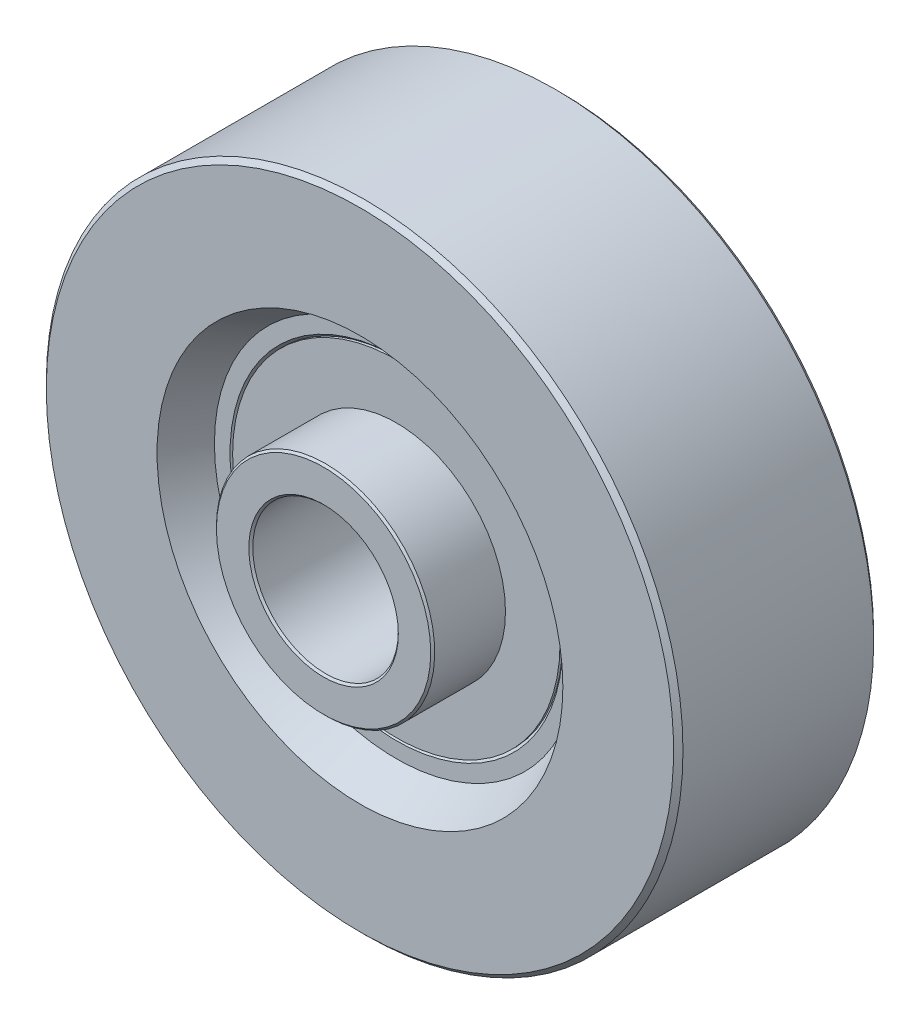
ISO-10303-21;
HEADER;
FILE_DESCRIPTION(('STEP AP214'),'2;1');
FILE_NAME('part.step','',(''),(''),'','','');
FILE_SCHEMA(('AUTOMOTIVE_DESIGN { 1 0 10303 214 1 1 1 1 }'));
ENDSEC;
DATA;
#1=APPLICATION_CONTEXT('core data for automotive mechanical design processes');
#2=APPLICATION_PROTOCOL_DEFINITION('international standard','automotive_design',2000,#1);
#3=PRODUCT_CONTEXT('',#1,'mechanical');
#4=PRODUCT('Part','Part','',(#3));
#5=PRODUCT_RELATED_PRODUCT_CATEGORY('part','',(#4));
#6=PRODUCT_DEFINITION_FORMATION('','',#4);
#7=PRODUCT_DEFINITION_CONTEXT('part definition',#1,'design');
#8=PRODUCT_DEFINITION('design','',#6,#7);
#9=PRODUCT_DEFINITION_SHAPE('','',#8);
#10=(LENGTH_UNIT() NAMED_UNIT(*) SI_UNIT(.MILLI.,.METRE.));
#11=(NAMED_UNIT(*) PLANE_ANGLE_UNIT() SI_UNIT($,.RADIAN.));
#12=(NAMED_UNIT(*) SI_UNIT($,.STERADIAN.) SOLID_ANGLE_UNIT());
#13=UNCERTAINTY_MEASURE_WITH_UNIT(LENGTH_MEASURE(1.E-05),#10,'distance_accuracy_value','');
#14=(GEOMETRIC_REPRESENTATION_CONTEXT(3) GLOBAL_UNCERTAINTY_ASSIGNED_CONTEXT((#13)) GLOBAL_UNIT_ASSIGNED_CONTEXT((#10,
#11,#12)) REPRESENTATION_CONTEXT('',''));
#15=CARTESIAN_POINT('',(0.,0.,0.));
#16=DIRECTION('',(0.,0.,1.));
#17=DIRECTION('',(1.,0.,0.));
#18=AXIS2_PLACEMENT_3D('',#15,#16,#17);
#19=CARTESIAN_POINT('',(0.,0.,0.));
#20=DIRECTION('',(0.,0.,-1.));
#21=DIRECTION('',(-1.,0.,0.));
#22=AXIS2_PLACEMENT_3D('',#19,#20,#21);
#23=CYLINDRICAL_SURFACE('',#22,4.);
#24=CARTESIAN_POINT('',(0.,0.,-7.3909090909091));
#25=DIRECTION('',(0.,0.,-1.));
#26=DIRECTION('',(-1.,0.,0.));
#27=AXIS2_PLACEMENT_3D('',#24,#25,#26);
#28=CIRCLE('',#27,4.);
#29=CARTESIAN_POINT('',(-4.,0.,-7.3909090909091));
#30=VERTEX_POINT('',#29);
#31=EDGE_CURVE('E24',#30,#30,#28,.F.);
#32=ORIENTED_EDGE('',*,*,#31,.F.);
#33=EDGE_LOOP('',(#32));
#34=FACE_BOUND('',#33,.T.);
#35=CARTESIAN_POINT('',(0.,0.,7.3909090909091));
#36=DIRECTION('',(0.,0.,-1.));
#37=DIRECTION('',(-1.,0.,0.));
#38=AXIS2_PLACEMENT_3D('',#35,#36,#37);
#39=CIRCLE('',#38,4.);
#40=CARTESIAN_POINT('',(-4.,0.,7.3909090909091));
#41=VERTEX_POINT('',#40);
#42=EDGE_CURVE('E325',#41,#41,#39,.T.);
#43=ORIENTED_EDGE('',*,*,#42,.F.);
#44=EDGE_LOOP('',(#43));
#45=FACE_BOUND('',#44,.T.);
#46=ADVANCED_FACE('F12',(#34,#45),#23,.F.);
#47=CARTESIAN_POINT('',(0.,0.,-7.49999999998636));
#48=DIRECTION('',(0.,0.,-1.));
#49=DIRECTION('',(-1.,0.,0.));
#50=AXIS2_PLACEMENT_3D('',#47,#48,#49);
#51=CONICAL_SURFACE('',#50,4.10909090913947,0.785398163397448);
#52=CARTESIAN_POINT('',(0.,0.,-7.49999999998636));
#53=DIRECTION('',(0.,0.,-1.));
#54=DIRECTION('',(-1.,0.,0.));
#55=AXIS2_PLACEMENT_3D('',#52,#53,#54);
#56=CIRCLE('',#55,4.10909090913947);
#57=CARTESIAN_POINT('',(-4.10909090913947,0.,-7.49999999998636));
#58=VERTEX_POINT('',#57);
#59=EDGE_CURVE('E326',#58,#58,#56,.F.);
#60=ORIENTED_EDGE('',*,*,#59,.F.);
#61=EDGE_LOOP('',(#60));
#62=FACE_BOUND('',#61,.T.);
#63=ORIENTED_EDGE('',*,*,#31,.T.);
#64=EDGE_LOOP('',(#63));
#65=FACE_BOUND('',#64,.T.);
#66=ADVANCED_FACE('F291',(#62,#65),#51,.F.);
#67=CARTESIAN_POINT('',(0.,5.,-7.5));
#68=DIRECTION('',(0.,0.,-1.));
#69=DIRECTION('',(-1.,0.,0.));
#70=AXIS2_PLACEMENT_3D('',#67,#68,#69);
#71=PLANE('',#70);
#72=ORIENTED_EDGE('',*,*,#59,.T.);
#73=EDGE_LOOP('',(#72));
#74=FACE_BOUND('',#73,.T.);
#75=CARTESIAN_POINT('',(0.,0.,-7.49999999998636));
#76=DIRECTION('',(0.,0.,1.));
#77=DIRECTION('',(1.,0.,0.));
#78=AXIS2_PLACEMENT_3D('',#75,#76,#77);
#79=CIRCLE('',#78,5.89090909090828);
#80=CARTESIAN_POINT('',(5.89090909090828,0.,-7.49999999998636));
#81=VERTEX_POINT('',#80);
#82=EDGE_CURVE('E339',#81,#81,#79,.F.);
#83=ORIENTED_EDGE('',*,*,#82,.T.);
#84=EDGE_LOOP('',(#83));
#85=FACE_BOUND('',#84,.T.);
#86=ADVANCED_FACE('F282',(#74,#85),#71,.T.);
#87=CARTESIAN_POINT('',(0.,0.,-7.39090909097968));
#88=DIRECTION('',(0.,0.,1.));
#89=DIRECTION('',(1.,0.,0.));
#90=AXIS2_PLACEMENT_3D('',#87,#88,#89);
#91=CONICAL_SURFACE('',#90,5.99999999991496,0.785398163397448);
#92=CARTESIAN_POINT('',(0.,0.,-7.39090909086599));
#93=DIRECTION('',(0.,0.,1.));
#94=DIRECTION('',(0.,1.,0.));
#95=AXIS2_PLACEMENT_3D('',#92,#93,#94);
#96=CIRCLE('',#95,5.99999999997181);
#97=CARTESIAN_POINT('',(0.,5.99999999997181,-7.39090909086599));
#98=VERTEX_POINT('',#97);
#99=EDGE_CURVE('E333',#98,#98,#96,.F.);
#100=ORIENTED_EDGE('',*,*,#99,.T.);
#101=EDGE_LOOP('',(#100));
#102=FACE_BOUND('',#101,.T.);
#103=ORIENTED_EDGE('',*,*,#82,.F.);
#104=EDGE_LOOP('',(#103));
#105=FACE_BOUND('',#104,.T.);
#106=ADVANCED_FACE('F273',(#102,#105),#91,.T.);
#107=CARTESIAN_POINT('',(0.,0.,-4.0586961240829));
#108=DIRECTION('',(0.,0.,-1.));
#109=DIRECTION('',(-1.,0.,0.));
#110=AXIS2_PLACEMENT_3D('',#107,#108,#109);
#111=CYLINDRICAL_SURFACE('',#110,6.);
#112=CARTESIAN_POINT('',(0.,0.,-3.5));
#113=DIRECTION('',(0.,0.,-1.));
#114=DIRECTION('',(-1.,0.,0.));
#115=AXIS2_PLACEMENT_3D('',#112,#113,#114);
#116=CIRCLE('',#115,6.);
#117=CARTESIAN_POINT('',(-6.,0.,-3.5));
#118=VERTEX_POINT('',#117);
#119=EDGE_CURVE('E16',#118,#118,#116,.F.);
#120=ORIENTED_EDGE('',*,*,#119,.F.);
#121=EDGE_LOOP('',(#120));
#122=FACE_BOUND('',#121,.T.);
#123=ORIENTED_EDGE('',*,*,#99,.F.);
#124=EDGE_LOOP('',(#123));
#125=FACE_BOUND('',#124,.T.);
#126=ADVANCED_FACE('F264',(#122,#125),#111,.T.);
#127=CARTESIAN_POINT('',(0.,0.,7.5));
#128=DIRECTION('',(0.,0.,1.));
#129=DIRECTION('',(1.,0.,0.));
#130=AXIS2_PLACEMENT_3D('',#127,#128,#129);
#131=CONICAL_SURFACE('',#130,4.10909090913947,0.785398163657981);
#132=ORIENTED_EDGE('',*,*,#42,.T.);
#133=EDGE_LOOP('',(#132));
#134=FACE_BOUND('',#133,.T.);
#135=CARTESIAN_POINT('',(0.,0.,7.5));
#136=DIRECTION('',(0.,0.,1.));
#137=DIRECTION('',(1.,0.,0.));
#138=AXIS2_PLACEMENT_3D('',#135,#136,#137);
#139=CIRCLE('',#138,4.10909090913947);
#140=CARTESIAN_POINT('',(4.10909090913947,0.,7.5));
#141=VERTEX_POINT('',#140);
#142=EDGE_CURVE('E330',#141,#141,#139,.F.);
#143=ORIENTED_EDGE('',*,*,#142,.F.);
#144=EDGE_LOOP('',(#143));
#145=FACE_BOUND('',#144,.T.);
#146=ADVANCED_FACE('F255',(#134,#145),#131,.F.);
#147=CARTESIAN_POINT('',(0.,5.,7.5));
#148=DIRECTION('',(0.,0.,1.));
#149=DIRECTION('',(1.,0.,0.));
#150=AXIS2_PLACEMENT_3D('',#147,#148,#149);
#151=PLANE('',#150);
#152=CARTESIAN_POINT('',(0.,0.,7.5));
#153=DIRECTION('',(0.,0.,-1.));
#154=DIRECTION('',(-1.,0.,0.));
#155=AXIS2_PLACEMENT_3D('',#152,#153,#154);
#156=CIRCLE('',#155,5.89090909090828);
#157=CARTESIAN_POINT('',(-5.89090909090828,0.,7.5));
#158=VERTEX_POINT('',#157);
#159=EDGE_CURVE('E27',#158,#158,#156,.F.);
#160=ORIENTED_EDGE('',*,*,#159,.T.);
#161=EDGE_LOOP('',(#160));
#162=FACE_BOUND('',#161,.T.);
#163=ORIENTED_EDGE('',*,*,#142,.T.);
#164=EDGE_LOOP('',(#163));
#165=FACE_BOUND('',#164,.T.);
#166=ADVANCED_FACE('F246',(#162,#165),#151,.T.);
#167=CARTESIAN_POINT('',(0.,0.,7.39090909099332));
#168=DIRECTION('',(0.,0.,-1.));
#169=DIRECTION('',(-1.,0.,0.));
#170=AXIS2_PLACEMENT_3D('',#167,#168,#169);
#171=CONICAL_SURFACE('',#170,5.99999999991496,0.785398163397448);
#172=ORIENTED_EDGE('',*,*,#159,.F.);
#173=EDGE_LOOP('',(#172));
#174=FACE_BOUND('',#173,.T.);
#175=CARTESIAN_POINT('',(0.,0.,7.39090909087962));
#176=DIRECTION('',(0.,0.,-1.));
#177=DIRECTION('',(0.,1.,0.));
#178=AXIS2_PLACEMENT_3D('',#175,#176,#177);
#179=CIRCLE('',#178,5.99999999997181);
#180=CARTESIAN_POINT('',(0.,5.99999999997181,7.39090909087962));
#181=VERTEX_POINT('',#180);
#182=EDGE_CURVE('E47',#181,#181,#179,.F.);
#183=ORIENTED_EDGE('',*,*,#182,.T.);
#184=EDGE_LOOP('',(#183));
#185=FACE_BOUND('',#184,.T.);
#186=ADVANCED_FACE('F239',(#174,#185),#171,.T.);
#187=CARTESIAN_POINT('',(0.,0.,4.05869612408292));
#188=DIRECTION('',(0.,0.,-1.));
#189=DIRECTION('',(-1.,0.,0.));
#190=AXIS2_PLACEMENT_3D('',#187,#188,#189);
#191=CYLINDRICAL_SURFACE('',#190,6.);
#192=ORIENTED_EDGE('',*,*,#182,.F.);
#193=EDGE_LOOP('',(#192));
#194=FACE_BOUND('',#193,.T.);
#195=CARTESIAN_POINT('',(0.,0.,3.5));
#196=DIRECTION('',(0.,0.,1.));
#197=DIRECTION('',(1.,0.,0.));
#198=AXIS2_PLACEMENT_3D('',#195,#196,#197);
#199=CIRCLE('',#198,6.);
#200=CARTESIAN_POINT('',(6.,0.,3.5));
#201=VERTEX_POINT('',#200);
#202=EDGE_CURVE('E8',#201,#201,#199,.F.);
#203=ORIENTED_EDGE('',*,*,#202,.F.);
#204=EDGE_LOOP('',(#203));
#205=FACE_BOUND('',#204,.T.);
#206=ADVANCED_FACE('F116',(#194,#205),#191,.T.);
#207=CARTESIAN_POINT('',(0.,0.,0.));
#208=DIRECTION('',(0.,0.,-1.));
#209=DIRECTION('',(-1.,0.,0.));
#210=AXIS2_PLACEMENT_3D('',#207,#208,#209);
#211=CYLINDRICAL_SURFACE('',#210,17.5);
#212=CARTESIAN_POINT('',(0.,0.,5.24264705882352));
#213=DIRECTION('',(0.,0.,-1.));
#214=DIRECTION('',(-1.,0.,0.));
#215=AXIS2_PLACEMENT_3D('',#212,#213,#214);
#216=CIRCLE('',#215,17.5);
#217=CARTESIAN_POINT('',(-17.5,0.,5.24264705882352));
#218=VERTEX_POINT('',#217);
#219=EDGE_CURVE('E34',#218,#218,#216,.T.);
#220=ORIENTED_EDGE('',*,*,#219,.T.);
#221=EDGE_LOOP('',(#220));
#222=FACE_BOUND('',#221,.T.);
#223=CARTESIAN_POINT('',(0.,0.,-5.2426470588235));
#224=DIRECTION('',(0.,0.,-1.));
#225=DIRECTION('',(-1.,0.,0.));
#226=AXIS2_PLACEMENT_3D('',#223,#224,#225);
#227=CIRCLE('',#226,17.5);
#228=CARTESIAN_POINT('',(-17.5,0.,-5.2426470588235));
#229=VERTEX_POINT('',#228);
#230=EDGE_CURVE('E33',#229,#229,#227,.F.);
#231=ORIENTED_EDGE('',*,*,#230,.T.);
#232=EDGE_LOOP('',(#231));
#233=FACE_BOUND('',#232,.T.);
#234=ADVANCED_FACE('F86',(#222,#233),#211,.T.);
#235=CARTESIAN_POINT('',(0.,0.,-5.24264705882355));
#236=DIRECTION('',(0.,0.,1.));
#237=DIRECTION('',(1.,0.,0.));
#238=AXIS2_PLACEMENT_3D('',#235,#236,#237);
#239=CONICAL_SURFACE('',#238,17.5,0.785398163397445);
#240=CARTESIAN_POINT('',(0.,0.,-5.5));
#241=DIRECTION('',(0.,0.,1.));
#242=DIRECTION('',(1.,0.,0.));
#243=AXIS2_PLACEMENT_3D('',#240,#241,#242);
#244=CIRCLE('',#243,17.2426470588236);
#245=CARTESIAN_POINT('',(17.2426470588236,0.,-5.5));
#246=VERTEX_POINT('',#245);
#247=EDGE_CURVE('E37',#246,#246,#244,.T.);
#248=ORIENTED_EDGE('',*,*,#247,.T.);
#249=EDGE_LOOP('',(#248));
#250=FACE_BOUND('',#249,.T.);
#251=ORIENTED_EDGE('',*,*,#230,.F.);
#252=EDGE_LOOP('',(#251));
#253=FACE_BOUND('',#252,.T.);
#254=ADVANCED_FACE('F115',(#250,#253),#239,.T.);
#255=CARTESIAN_POINT('',(0.,14.1986737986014,-5.5));
#256=DIRECTION('',(0.,0.,-1.));
#257=DIRECTION('',(-1.,0.,0.));
#258=AXIS2_PLACEMENT_3D('',#255,#256,#257);
#259=PLANE('',#258);
#260=CARTESIAN_POINT('',(0.,0.,-5.5));
#261=DIRECTION('',(0.,0.,-1.));
#262=DIRECTION('',(-1.,0.,0.));
#263=AXIS2_PLACEMENT_3D('',#260,#261,#262);
#264=CIRCLE('',#263,11.1547005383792);
#265=CARTESIAN_POINT('',(-11.1547005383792,0.,-5.5));
#266=VERTEX_POINT('',#265);
#267=EDGE_CURVE('E53',#266,#266,#264,.F.);
#268=ORIENTED_EDGE('',*,*,#267,.T.);
#269=EDGE_LOOP('',(#268));
#270=FACE_BOUND('',#269,.T.);
#271=ORIENTED_EDGE('',*,*,#247,.F.);
#272=EDGE_LOOP('',(#271));
#273=FACE_BOUND('',#272,.T.);
#274=ADVANCED_FACE('F119',(#270,#273),#259,.T.);
#275=CARTESIAN_POINT('',(0.,0.,-5.5));
#276=DIRECTION('',(0.,0.,-1.));
#277=DIRECTION('',(-1.,0.,0.));
#278=AXIS2_PLACEMENT_3D('',#275,#276,#277);
#279=CONICAL_SURFACE('',#278,11.1547005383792,0.523598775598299);
#280=ORIENTED_EDGE('',*,*,#267,.F.);
#281=EDGE_LOOP('',(#280));
#282=FACE_BOUND('',#281,.T.);
#283=CARTESIAN_POINT('',(0.,0.,-3.5));
#284=DIRECTION('',(0.,0.,-1.));
#285=DIRECTION('',(-1.,0.,0.));
#286=AXIS2_PLACEMENT_3D('',#283,#284,#285);
#287=CIRCLE('',#286,10.);
#288=CARTESIAN_POINT('',(-10.,0.,-3.5));
#289=VERTEX_POINT('',#288);
#290=EDGE_CURVE('E59',#289,#289,#287,.T.);
#291=ORIENTED_EDGE('',*,*,#290,.F.);
#292=EDGE_LOOP('',(#291));
#293=FACE_BOUND('',#292,.T.);
#294=ADVANCED_FACE('F123',(#282,#293),#279,.F.);
#295=CARTESIAN_POINT('',(0.,9.57,-3.5));
#296=DIRECTION('',(0.,0.,-1.));
#297=DIRECTION('',(-1.,0.,0.));
#298=AXIS2_PLACEMENT_3D('',#295,#296,#297);
#299=PLANE('',#298);
#300=CARTESIAN_POINT('',(0.,0.,-3.5));
#301=DIRECTION('',(0.,0.,-1.));
#302=DIRECTION('',(-1.,0.,0.));
#303=AXIS2_PLACEMENT_3D('',#300,#301,#302);
#304=CIRCLE('',#303,9.14);
#305=CARTESIAN_POINT('',(-9.14,0.,-3.5));
#306=VERTEX_POINT('',#305);
#307=EDGE_CURVE('E65',#306,#306,#304,.F.);
#308=ORIENTED_EDGE('',*,*,#307,.T.);
#309=EDGE_LOOP('',(#308));
#310=FACE_BOUND('',#309,.T.);
#311=ORIENTED_EDGE('',*,*,#290,.T.);
#312=EDGE_LOOP('',(#311));
#313=FACE_BOUND('',#312,.T.);
#314=ADVANCED_FACE('F128',(#310,#313),#299,.T.);
#315=CARTESIAN_POINT('',(0.,0.,-3.5));
#316=DIRECTION('',(0.,0.,-1.));
#317=DIRECTION('',(-1.,0.,0.));
#318=AXIS2_PLACEMENT_3D('',#315,#316,#317);
#319=CONICAL_SURFACE('',#318,9.14,0.785398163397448);
#320=ORIENTED_EDGE('',*,*,#307,.F.);
#321=EDGE_LOOP('',(#320));
#322=FACE_BOUND('',#321,.T.);
#323=CARTESIAN_POINT('',(0.,0.,-3.36));
#324=DIRECTION('',(0.,0.,-1.));
#325=DIRECTION('',(0.,1.,0.));
#326=AXIS2_PLACEMENT_3D('',#323,#324,#325);
#327=CIRCLE('',#326,9.);
#328=CARTESIAN_POINT('',(0.,9.,-3.36));
#329=VERTEX_POINT('',#328);
#330=EDGE_CURVE('E40',#329,#329,#327,.T.);
#331=ORIENTED_EDGE('',*,*,#330,.F.);
#332=EDGE_LOOP('',(#331));
#333=FACE_BOUND('',#332,.T.);
#334=ADVANCED_FACE('F87',(#322,#333),#319,.F.);
#335=CARTESIAN_POINT('',(0.,0.,-3.0625));
#336=DIRECTION('',(0.,0.,-1.));
#337=DIRECTION('',(-1.,0.,0.));
#338=AXIS2_PLACEMENT_3D('',#335,#336,#337);
#339=CYLINDRICAL_SURFACE('',#338,9.);
#340=ORIENTED_EDGE('',*,*,#330,.T.);
#341=EDGE_LOOP('',(#340));
#342=FACE_BOUND('',#341,.T.);
#343=CARTESIAN_POINT('',(0.,0.,-3.5));
#344=DIRECTION('',(0.,0.,-1.));
#345=DIRECTION('',(-1.,0.,0.));
#346=AXIS2_PLACEMENT_3D('',#343,#344,#345);
#347=CIRCLE('',#346,9.);
#348=CARTESIAN_POINT('',(-9.,0.,-3.5));
#349=VERTEX_POINT('',#348);
#350=EDGE_CURVE('E44',#349,#349,#347,.F.);
#351=ORIENTED_EDGE('',*,*,#350,.T.);
#352=EDGE_LOOP('',(#351));
#353=FACE_BOUND('',#352,.T.);
#354=ADVANCED_FACE('F72',(#342,#353),#339,.T.);
#355=CARTESIAN_POINT('',(0.,7.5,-3.5));
#356=DIRECTION('',(0.,0.,-1.));
#357=DIRECTION('',(-1.,0.,0.));
#358=AXIS2_PLACEMENT_3D('',#355,#356,#357);
#359=PLANE('',#358);
#360=ORIENTED_EDGE('',*,*,#119,.T.);
#361=EDGE_LOOP('',(#360));
#362=FACE_BOUND('',#361,.T.);
#363=ORIENTED_EDGE('',*,*,#350,.F.);
#364=EDGE_LOOP('',(#363));
#365=FACE_BOUND('',#364,.T.);
#366=ADVANCED_FACE('F14',(#362,#365),#359,.T.);
#367=CARTESIAN_POINT('',(0.,0.,5.24264705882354));
#368=DIRECTION('',(0.,0.,-1.));
#369=DIRECTION('',(-1.,0.,0.));
#370=AXIS2_PLACEMENT_3D('',#367,#368,#369);
#371=CONICAL_SURFACE('',#370,17.5,0.785398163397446);
#372=CARTESIAN_POINT('',(0.,0.,5.5));
#373=DIRECTION('',(0.,0.,-1.));
#374=DIRECTION('',(-1.,0.,0.));
#375=AXIS2_PLACEMENT_3D('',#372,#373,#374);
#376=CIRCLE('',#375,17.2426470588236);
#377=CARTESIAN_POINT('',(-17.2426470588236,0.,5.5));
#378=VERTEX_POINT('',#377);
#379=EDGE_CURVE('E50',#378,#378,#376,.T.);
#380=ORIENTED_EDGE('',*,*,#379,.T.);
#381=EDGE_LOOP('',(#380));
#382=FACE_BOUND('',#381,.T.);
#383=ORIENTED_EDGE('',*,*,#219,.F.);
#384=EDGE_LOOP('',(#383));
#385=FACE_BOUND('',#384,.T.);
#386=ADVANCED_FACE('F75',(#382,#385),#371,.T.);
#387=CARTESIAN_POINT('',(0.,14.1986737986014,5.5));
#388=DIRECTION('',(0.,0.,1.));
#389=DIRECTION('',(1.,0.,0.));
#390=AXIS2_PLACEMENT_3D('',#387,#388,#389);
#391=PLANE('',#390);
#392=ORIENTED_EDGE('',*,*,#379,.F.);
#393=EDGE_LOOP('',(#392));
#394=FACE_BOUND('',#393,.T.);
#395=CARTESIAN_POINT('',(0.,0.,5.5));
#396=DIRECTION('',(0.,0.,1.));
#397=DIRECTION('',(1.,0.,0.));
#398=AXIS2_PLACEMENT_3D('',#395,#396,#397);
#399=CIRCLE('',#398,11.1547005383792);
#400=CARTESIAN_POINT('',(11.1547005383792,0.,5.5));
#401=VERTEX_POINT('',#400);
#402=EDGE_CURVE('E56',#401,#401,#399,.F.);
#403=ORIENTED_EDGE('',*,*,#402,.T.);
#404=EDGE_LOOP('',(#403));
#405=FACE_BOUND('',#404,.T.);
#406=ADVANCED_FACE('F77',(#394,#405),#391,.T.);
#407=CARTESIAN_POINT('',(0.,0.,5.5));
#408=DIRECTION('',(0.,0.,1.));
#409=DIRECTION('',(1.,0.,0.));
#410=AXIS2_PLACEMENT_3D('',#407,#408,#409);
#411=CONICAL_SURFACE('',#410,11.1547005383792,0.523598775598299);
#412=CARTESIAN_POINT('',(0.,0.,3.5));
#413=DIRECTION('',(0.,0.,1.));
#414=DIRECTION('',(1.,0.,0.));
#415=AXIS2_PLACEMENT_3D('',#412,#413,#414);
#416=CIRCLE('',#415,10.);
#417=CARTESIAN_POINT('',(10.,0.,3.5));
#418=VERTEX_POINT('',#417);
#419=EDGE_CURVE('E62',#418,#418,#416,.T.);
#420=ORIENTED_EDGE('',*,*,#419,.F.);
#421=EDGE_LOOP('',(#420));
#422=FACE_BOUND('',#421,.T.);
#423=ORIENTED_EDGE('',*,*,#402,.F.);
#424=EDGE_LOOP('',(#423));
#425=FACE_BOUND('',#424,.T.);
#426=ADVANCED_FACE('F91',(#422,#425),#411,.F.);
#427=CARTESIAN_POINT('',(0.,9.57,3.5));
#428=DIRECTION('',(0.,0.,1.));
#429=DIRECTION('',(1.,0.,0.));
#430=AXIS2_PLACEMENT_3D('',#427,#428,#429);
#431=PLANE('',#430);
#432=ORIENTED_EDGE('',*,*,#419,.T.);
#433=EDGE_LOOP('',(#432));
#434=FACE_BOUND('',#433,.T.);
#435=CARTESIAN_POINT('',(0.,0.,3.5));
#436=DIRECTION('',(0.,0.,1.));
#437=DIRECTION('',(1.,0.,0.));
#438=AXIS2_PLACEMENT_3D('',#435,#436,#437);
#439=CIRCLE('',#438,9.14);
#440=CARTESIAN_POINT('',(9.14,0.,3.5));
#441=VERTEX_POINT('',#440);
#442=EDGE_CURVE('E43',#441,#441,#439,.F.);
#443=ORIENTED_EDGE('',*,*,#442,.T.);
#444=EDGE_LOOP('',(#443));
#445=FACE_BOUND('',#444,.T.);
#446=ADVANCED_FACE('F106',(#434,#445),#431,.T.);
#447=CARTESIAN_POINT('',(0.,0.,3.5));
#448=DIRECTION('',(0.,0.,1.));
#449=DIRECTION('',(1.,0.,0.));
#450=AXIS2_PLACEMENT_3D('',#447,#448,#449);
#451=CONICAL_SURFACE('',#450,9.14,0.785398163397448);
#452=CARTESIAN_POINT('',(0.,0.,3.36));
#453=DIRECTION('',(0.,0.,1.));
#454=DIRECTION('',(0.,1.,0.));
#455=AXIS2_PLACEMENT_3D('',#452,#453,#454);
#456=CIRCLE('',#455,9.);
#457=CARTESIAN_POINT('',(0.,9.,3.36));
#458=VERTEX_POINT('',#457);
#459=EDGE_CURVE('E32',#458,#458,#456,.T.);
#460=ORIENTED_EDGE('',*,*,#459,.F.);
#461=EDGE_LOOP('',(#460));
#462=FACE_BOUND('',#461,.T.);
#463=ORIENTED_EDGE('',*,*,#442,.F.);
#464=EDGE_LOOP('',(#463));
#465=FACE_BOUND('',#464,.T.);
#466=ADVANCED_FACE('F96',(#462,#465),#451,.F.);
#467=CARTESIAN_POINT('',(0.,0.,3.0625));
#468=DIRECTION('',(0.,0.,-1.));
#469=DIRECTION('',(-1.,0.,0.));
#470=AXIS2_PLACEMENT_3D('',#467,#468,#469);
#471=CYLINDRICAL_SURFACE('',#470,9.);
#472=CARTESIAN_POINT('',(0.,0.,3.5));
#473=DIRECTION('',(0.,0.,-1.));
#474=DIRECTION('',(-1.,0.,0.));
#475=AXIS2_PLACEMENT_3D('',#472,#473,#474);
#476=CIRCLE('',#475,9.);
#477=CARTESIAN_POINT('',(-9.,0.,3.5));
#478=VERTEX_POINT('',#477);
#479=EDGE_CURVE('E29',#478,#478,#476,.F.);
#480=ORIENTED_EDGE('',*,*,#479,.F.);
#481=EDGE_LOOP('',(#480));
#482=FACE_BOUND('',#481,.T.);
#483=ORIENTED_EDGE('',*,*,#459,.T.);
#484=EDGE_LOOP('',(#483));
#485=FACE_BOUND('',#484,.T.);
#486=ADVANCED_FACE('F94',(#482,#485),#471,.T.);
#487=CARTESIAN_POINT('',(0.,7.5,3.5));
#488=DIRECTION('',(0.,0.,1.));
#489=DIRECTION('',(1.,0.,0.));
#490=AXIS2_PLACEMENT_3D('',#487,#488,#489);
#491=PLANE('',#490);
#492=ORIENTED_EDGE('',*,*,#479,.T.);
#493=EDGE_LOOP('',(#492));
#494=FACE_BOUND('',#493,.T.);
#495=ORIENTED_EDGE('',*,*,#202,.T.);
#496=EDGE_LOOP('',(#495));
#497=FACE_BOUND('',#496,.T.);
#498=ADVANCED_FACE('F89',(#494,#497),#491,.T.);
#499=CLOSED_SHELL('',(#46,#66,#86,#106,#126,#146,#166,#186,#206,#234,#254,#274,#294,#314,#334,
#354,#366,#386,#406,#426,#446,#466,#486,#498));
#500=MANIFOLD_SOLID_BREP('B1',#499);
#501=ADVANCED_BREP_SHAPE_REPRESENTATION('',(#18,#500),#14);
#502=SHAPE_DEFINITION_REPRESENTATION(#9,#501);
ENDSEC;
END-ISO-10303-21;
